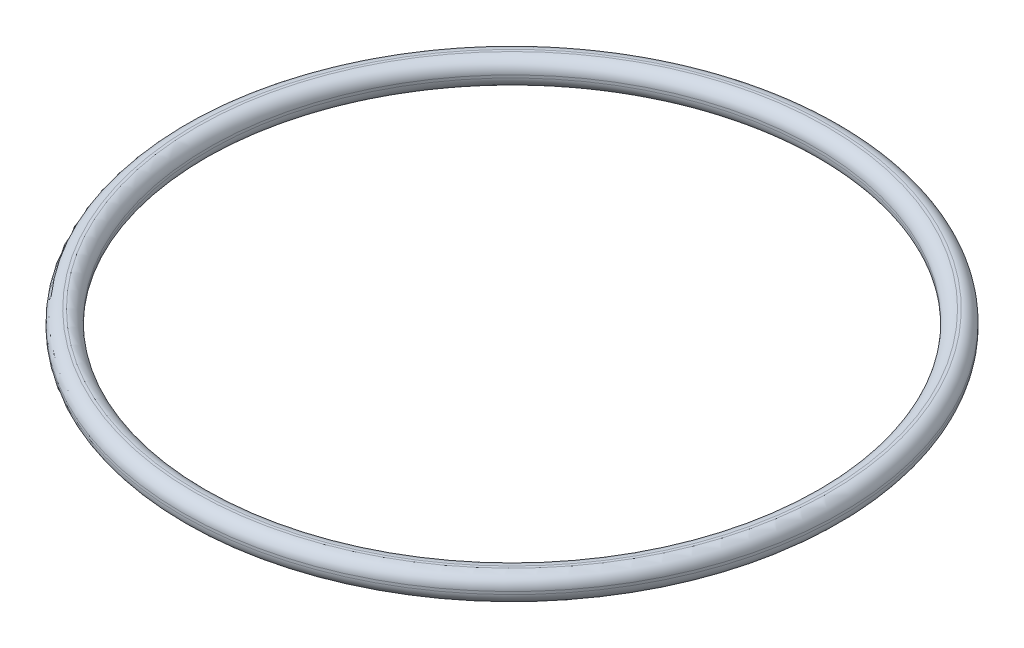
ISO-10303-21;
HEADER;
FILE_DESCRIPTION(('STEP AP214'),'2;1');
FILE_NAME('part.step','',(''),(''),'','','');
FILE_SCHEMA(('AUTOMOTIVE_DESIGN { 1 0 10303 214 1 1 1 1 }'));
ENDSEC;
DATA;
#1=APPLICATION_CONTEXT('core data for automotive mechanical design processes');
#2=APPLICATION_PROTOCOL_DEFINITION('international standard','automotive_design',2000,#1);
#3=PRODUCT_CONTEXT('',#1,'mechanical');
#4=PRODUCT('Part','Part','',(#3));
#5=PRODUCT_RELATED_PRODUCT_CATEGORY('part','',(#4));
#6=PRODUCT_DEFINITION_FORMATION('','',#4);
#7=PRODUCT_DEFINITION_CONTEXT('part definition',#1,'design');
#8=PRODUCT_DEFINITION('design','',#6,#7);
#9=PRODUCT_DEFINITION_SHAPE('','',#8);
#10=(LENGTH_UNIT() NAMED_UNIT(*) SI_UNIT(.MILLI.,.METRE.));
#11=(NAMED_UNIT(*) PLANE_ANGLE_UNIT() SI_UNIT($,.RADIAN.));
#12=(NAMED_UNIT(*) SI_UNIT($,.STERADIAN.) SOLID_ANGLE_UNIT());
#13=UNCERTAINTY_MEASURE_WITH_UNIT(LENGTH_MEASURE(1.E-05),#10,'distance_accuracy_value','');
#14=(GEOMETRIC_REPRESENTATION_CONTEXT(3) GLOBAL_UNCERTAINTY_ASSIGNED_CONTEXT((#13)) GLOBAL_UNIT_ASSIGNED_CONTEXT((#10,
#11,#12)) REPRESENTATION_CONTEXT('',''));
#15=CARTESIAN_POINT('',(0.,0.,0.));
#16=DIRECTION('',(0.,0.,1.));
#17=DIRECTION('',(1.,0.,0.));
#18=AXIS2_PLACEMENT_3D('',#15,#16,#17);
#19=CARTESIAN_POINT('',(0.,1.,0.));
#20=DIRECTION('',(0.,1.,0.));
#21=DIRECTION('',(0.,0.,1.));
#22=AXIS2_PLACEMENT_3D('',#19,#20,#21);
#23=PLANE('',#22);
#24=CARTESIAN_POINT('',(0.,1.,0.));
#25=DIRECTION('',(0.,1.,0.));
#26=DIRECTION('',(0.,0.,1.));
#27=AXIS2_PLACEMENT_3D('',#24,#25,#26);
#28=CIRCLE('',#27,12.05);
#29=CARTESIAN_POINT('',(0.,1.,12.05));
#30=VERTEX_POINT('',#29);
#31=EDGE_CURVE('E41',#30,#30,#28,.T.);
#32=ORIENTED_EDGE('',*,*,#31,.T.);
#33=EDGE_LOOP('',(#32));
#34=FACE_BOUND('',#33,.T.);
#35=CARTESIAN_POINT('',(0.,1.,0.));
#36=DIRECTION('',(0.,1.,0.));
#37=DIRECTION('',(0.,0.,1.));
#38=AXIS2_PLACEMENT_3D('',#35,#36,#37);
#39=CIRCLE('',#38,11.95);
#40=CARTESIAN_POINT('',(0.,1.,11.95));
#41=VERTEX_POINT('',#40);
#42=EDGE_CURVE('E45',#41,#41,#39,.F.);
#43=ORIENTED_EDGE('',*,*,#42,.T.);
#44=EDGE_LOOP('',(#43));
#45=FACE_BOUND('',#44,.T.);
#46=ADVANCED_FACE('F30',(#34,#45),#23,.T.);
#47=CARTESIAN_POINT('',(0.,0.,0.));
#48=DIRECTION('',(0.,1.,0.));
#49=DIRECTION('',(0.,0.,1.));
#50=AXIS2_PLACEMENT_3D('',#47,#48,#49);
#51=PLANE('',#50);
#52=CARTESIAN_POINT('',(0.,0.,0.));
#53=DIRECTION('',(0.,1.,0.));
#54=DIRECTION('',(0.,0.,1.));
#55=AXIS2_PLACEMENT_3D('',#52,#53,#54);
#56=CIRCLE('',#55,12.05);
#57=CARTESIAN_POINT('',(0.,0.,12.05));
#58=VERTEX_POINT('',#57);
#59=EDGE_CURVE('E50',#58,#58,#56,.F.);
#60=ORIENTED_EDGE('',*,*,#59,.T.);
#61=EDGE_LOOP('',(#60));
#62=FACE_BOUND('',#61,.T.);
#63=CARTESIAN_POINT('',(0.,0.,0.));
#64=DIRECTION('',(0.,1.,0.));
#65=DIRECTION('',(0.,0.,1.));
#66=AXIS2_PLACEMENT_3D('',#63,#64,#65);
#67=CIRCLE('',#66,11.95);
#68=CARTESIAN_POINT('',(0.,0.,11.95));
#69=VERTEX_POINT('',#68);
#70=EDGE_CURVE('E53',#69,#69,#67,.T.);
#71=ORIENTED_EDGE('',*,*,#70,.T.);
#72=EDGE_LOOP('',(#71));
#73=FACE_BOUND('',#72,.T.);
#74=ADVANCED_FACE('F75',(#62,#73),#51,.F.);
#75=CARTESIAN_POINT('',(0.,1.,0.));
#76=DIRECTION('',(0.,-1.,0.));
#77=DIRECTION('',(0.,0.,-1.));
#78=AXIS2_PLACEMENT_3D('',#75,#76,#77);
#79=CYLINDRICAL_SURFACE('',#78,12.5);
#80=CARTESIAN_POINT('',(0.,0.45,0.));
#81=DIRECTION('',(0.,1.,0.));
#82=DIRECTION('',(0.,0.,1.));
#83=AXIS2_PLACEMENT_3D('',#80,#81,#82);
#84=CIRCLE('',#83,12.5);
#85=CARTESIAN_POINT('',(0.,0.45,12.5));
#86=VERTEX_POINT('',#85);
#87=EDGE_CURVE('E56',#86,#86,#84,.T.);
#88=ORIENTED_EDGE('',*,*,#87,.T.);
#89=EDGE_LOOP('',(#88));
#90=FACE_BOUND('',#89,.T.);
#91=CARTESIAN_POINT('',(0.,0.55,0.));
#92=DIRECTION('',(0.,1.,0.));
#93=DIRECTION('',(0.,0.,1.));
#94=AXIS2_PLACEMENT_3D('',#91,#92,#93);
#95=CIRCLE('',#94,12.5);
#96=CARTESIAN_POINT('',(0.,0.55,12.5));
#97=VERTEX_POINT('',#96);
#98=EDGE_CURVE('E59',#97,#97,#95,.F.);
#99=ORIENTED_EDGE('',*,*,#98,.T.);
#100=EDGE_LOOP('',(#99));
#101=FACE_BOUND('',#100,.T.);
#102=ADVANCED_FACE('F63',(#90,#101),#79,.T.);
#103=CARTESIAN_POINT('',(0.,1.,0.));
#104=DIRECTION('',(0.,-1.,0.));
#105=DIRECTION('',(0.,0.,-1.));
#106=AXIS2_PLACEMENT_3D('',#103,#104,#105);
#107=CYLINDRICAL_SURFACE('',#106,11.5);
#108=CARTESIAN_POINT('',(0.,0.55,0.));
#109=DIRECTION('',(0.,1.,0.));
#110=DIRECTION('',(0.,0.,1.));
#111=AXIS2_PLACEMENT_3D('',#108,#109,#110);
#112=CIRCLE('',#111,11.5);
#113=CARTESIAN_POINT('',(0.,0.55,11.5));
#114=VERTEX_POINT('',#113);
#115=EDGE_CURVE('E10',#114,#114,#112,.T.);
#116=ORIENTED_EDGE('',*,*,#115,.T.);
#117=EDGE_LOOP('',(#116));
#118=FACE_BOUND('',#117,.T.);
#119=CARTESIAN_POINT('',(0.,0.45,0.));
#120=DIRECTION('',(0.,1.,0.));
#121=DIRECTION('',(0.,0.,1.));
#122=AXIS2_PLACEMENT_3D('',#119,#120,#121);
#123=CIRCLE('',#122,11.5);
#124=CARTESIAN_POINT('',(0.,0.45,11.5));
#125=VERTEX_POINT('',#124);
#126=EDGE_CURVE('E37',#125,#125,#123,.F.);
#127=ORIENTED_EDGE('',*,*,#126,.T.);
#128=EDGE_LOOP('',(#127));
#129=FACE_BOUND('',#128,.T.);
#130=ADVANCED_FACE('F88',(#118,#129),#107,.F.);
#131=CARTESIAN_POINT('',(0.,0.45,0.));
#132=DIRECTION('',(0.,1.,0.));
#133=DIRECTION('',(0.,0.,1.));
#134=AXIS2_PLACEMENT_3D('',#131,#132,#133);
#135=TOROIDAL_SURFACE('',#134,12.05,0.45);
#136=ORIENTED_EDGE('',*,*,#59,.F.);
#137=EDGE_LOOP('',(#136));
#138=FACE_BOUND('',#137,.T.);
#139=ORIENTED_EDGE('',*,*,#87,.F.);
#140=EDGE_LOOP('',(#139));
#141=FACE_BOUND('',#140,.T.);
#142=ADVANCED_FACE('F69',(#138,#141),#135,.T.);
#143=CARTESIAN_POINT('',(0.,0.55,0.));
#144=DIRECTION('',(0.,1.,0.));
#145=DIRECTION('',(0.,0.,1.));
#146=AXIS2_PLACEMENT_3D('',#143,#144,#145);
#147=TOROIDAL_SURFACE('',#146,12.05,0.45);
#148=ORIENTED_EDGE('',*,*,#98,.F.);
#149=EDGE_LOOP('',(#148));
#150=FACE_BOUND('',#149,.T.);
#151=ORIENTED_EDGE('',*,*,#31,.F.);
#152=EDGE_LOOP('',(#151));
#153=FACE_BOUND('',#152,.T.);
#154=ADVANCED_FACE('F65',(#150,#153),#147,.T.);
#155=CARTESIAN_POINT('',(0.,0.55,0.));
#156=DIRECTION('',(0.,1.,0.));
#157=DIRECTION('',(0.,0.,1.));
#158=AXIS2_PLACEMENT_3D('',#155,#156,#157);
#159=TOROIDAL_SURFACE('',#158,11.95,0.45);
#160=ORIENTED_EDGE('',*,*,#42,.F.);
#161=EDGE_LOOP('',(#160));
#162=FACE_BOUND('',#161,.T.);
#163=ORIENTED_EDGE('',*,*,#115,.F.);
#164=EDGE_LOOP('',(#163));
#165=FACE_BOUND('',#164,.T.);
#166=ADVANCED_FACE('F68',(#162,#165),#159,.T.);
#167=CARTESIAN_POINT('',(0.,0.45,0.));
#168=DIRECTION('',(0.,1.,0.));
#169=DIRECTION('',(0.,0.,1.));
#170=AXIS2_PLACEMENT_3D('',#167,#168,#169);
#171=TOROIDAL_SURFACE('',#170,11.95,0.45);
#172=ORIENTED_EDGE('',*,*,#126,.F.);
#173=EDGE_LOOP('',(#172));
#174=FACE_BOUND('',#173,.T.);
#175=ORIENTED_EDGE('',*,*,#70,.F.);
#176=EDGE_LOOP('',(#175));
#177=FACE_BOUND('',#176,.T.);
#178=ADVANCED_FACE('F32',(#174,#177),#171,.T.);
#179=CLOSED_SHELL('',(#46,#74,#102,#130,#142,#154,#166,#178));
#180=MANIFOLD_SOLID_BREP('B2',#179);
#181=ADVANCED_BREP_SHAPE_REPRESENTATION('',(#18,#180),#14);
#182=SHAPE_DEFINITION_REPRESENTATION(#9,#181);
ENDSEC;
END-ISO-10303-21;
